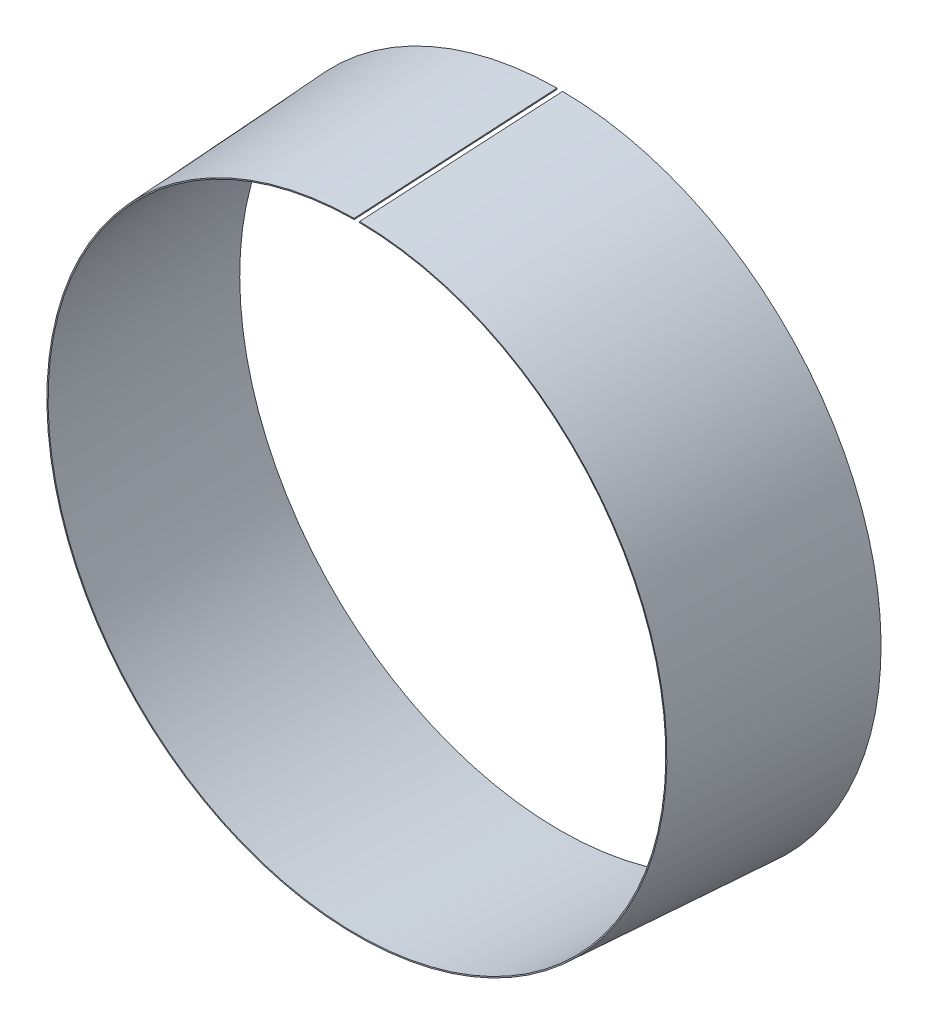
ISO-10303-21;
HEADER;
FILE_DESCRIPTION(('STEP AP214'),'2;1');
FILE_NAME('part.step','',(''),(''),'','','');
FILE_SCHEMA(('AUTOMOTIVE_DESIGN { 1 0 10303 214 1 1 1 1 }'));
ENDSEC;
DATA;
#1=APPLICATION_CONTEXT('core data for automotive mechanical design processes');
#2=APPLICATION_PROTOCOL_DEFINITION('international standard','automotive_design',2000,#1);
#3=PRODUCT_CONTEXT('',#1,'mechanical');
#4=PRODUCT('Part','Part','',(#3));
#5=PRODUCT_RELATED_PRODUCT_CATEGORY('part','',(#4));
#6=PRODUCT_DEFINITION_FORMATION('','',#4);
#7=PRODUCT_DEFINITION_CONTEXT('part definition',#1,'design');
#8=PRODUCT_DEFINITION('design','',#6,#7);
#9=PRODUCT_DEFINITION_SHAPE('','',#8);
#10=(LENGTH_UNIT() NAMED_UNIT(*) SI_UNIT(.MILLI.,.METRE.));
#11=(NAMED_UNIT(*) PLANE_ANGLE_UNIT() SI_UNIT($,.RADIAN.));
#12=(NAMED_UNIT(*) SI_UNIT($,.STERADIAN.) SOLID_ANGLE_UNIT());
#13=UNCERTAINTY_MEASURE_WITH_UNIT(LENGTH_MEASURE(1.E-05),#10,'distance_accuracy_value','');
#14=(GEOMETRIC_REPRESENTATION_CONTEXT(3) GLOBAL_UNCERTAINTY_ASSIGNED_CONTEXT((#13)) GLOBAL_UNIT_ASSIGNED_CONTEXT((#10,
#11,#12)) REPRESENTATION_CONTEXT('',''));
#15=CARTESIAN_POINT('',(0.,0.,0.));
#16=DIRECTION('',(0.,0.,1.));
#17=DIRECTION('',(1.,0.,0.));
#18=AXIS2_PLACEMENT_3D('',#15,#16,#17);
#19=CARTESIAN_POINT('',(-2.48706261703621,284.989148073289,0.));
#20=DIRECTION('',(-0.999961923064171,-0.00872653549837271,0.));
#21=DIRECTION('',(0.000484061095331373,-0.0554679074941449,0.998460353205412));
#22=AXIS2_PLACEMENT_3D('',#19,#20,#21);
#23=PLANE('',#22);
#24=DIRECTION('',(0.00871309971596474,-0.998422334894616,-0.0554700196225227));
#25=VECTOR('',#24,1.);
#26=CARTESIAN_POINT('',(-2.48706261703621,284.989148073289,0.));
#27=LINE('',#26,#25);
#28=CARTESIAN_POINT('',(-2.48706261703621,284.989148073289,0.));
#29=VERTEX_POINT('',#28);
#30=CARTESIAN_POINT('',(-2.47834951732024,283.990725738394,-0.0554700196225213));
#31=VERTEX_POINT('',#30);
#32=EDGE_CURVE('E12',#29,#31,#27,.T.);
#33=ORIENTED_EDGE('',*,*,#32,.F.);
#34=DIRECTION('',(0.000484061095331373,-0.0554679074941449,0.998460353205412));
#35=VECTOR('',#34,1.);
#36=CARTESIAN_POINT('',(-2.48706261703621,284.989148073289,0.));
#37=LINE('',#36,#35);
#38=CARTESIAN_POINT('',(-2.39979726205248,274.989528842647,180.));
#39=VERTEX_POINT('',#38);
#40=EDGE_CURVE('E98',#29,#39,#37,.T.);
#41=ORIENTED_EDGE('',*,*,#40,.T.);
#42=DIRECTION('',(0.00871309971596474,-0.998422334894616,-0.0554700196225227));
#43=VECTOR('',#42,1.);
#44=CARTESIAN_POINT('',(-2.39979726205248,274.989528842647,180.));
#45=LINE('',#44,#43);
#46=CARTESIAN_POINT('',(-2.39108416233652,273.991106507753,179.944529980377));
#47=VERTEX_POINT('',#46);
#48=EDGE_CURVE('E48',#39,#47,#45,.T.);
#49=ORIENTED_EDGE('',*,*,#48,.T.);
#50=DIRECTION('',(-0.000484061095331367,0.0554679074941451,-0.998460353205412));
#51=VECTOR('',#50,1.);
#52=CARTESIAN_POINT('',(-2.47834951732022,283.990725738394,-0.0554700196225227));
#53=LINE('',#52,#51);
#54=EDGE_CURVE('E107',#31,#47,#53,.F.);
#55=ORIENTED_EDGE('',*,*,#54,.F.);
#56=EDGE_LOOP('',(#33,#41,#49,#55));
#57=FACE_BOUND('',#56,.T.);
#58=ADVANCED_FACE('F38',(#57),#23,.F.);
#59=CARTESIAN_POINT('',(0.,0.,180.));
#60=DIRECTION('',(0.,0.,1.));
#61=DIRECTION('',(1.,0.,0.));
#62=AXIS2_PLACEMENT_3D('',#59,#60,#61);
#63=CONICAL_SURFACE('',#62,275.,1.51529782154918);
#64=ORIENTED_EDGE('',*,*,#48,.F.);
#65=CARTESIAN_POINT('',(0.,0.,180.));
#66=DIRECTION('',(0.,0.,1.));
#67=DIRECTION('',(1.,0.,0.));
#68=AXIS2_PLACEMENT_3D('',#65,#66,#67);
#69=CIRCLE('',#68,275.);
#70=CARTESIAN_POINT('',(2.39979726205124,274.989528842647,180.));
#71=VERTEX_POINT('',#70);
#72=EDGE_CURVE('E94',#39,#71,#69,.T.);
#73=ORIENTED_EDGE('',*,*,#72,.T.);
#74=DIRECTION('',(-0.00871309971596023,-0.998422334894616,-0.0554700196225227));
#75=VECTOR('',#74,1.);
#76=CARTESIAN_POINT('',(2.39979726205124,274.989528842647,180.));
#77=LINE('',#76,#75);
#78=CARTESIAN_POINT('',(2.39108416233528,273.991106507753,179.944529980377));
#79=VERTEX_POINT('',#78);
#80=EDGE_CURVE('E79',#71,#79,#77,.T.);
#81=ORIENTED_EDGE('',*,*,#80,.T.);
#82=CARTESIAN_POINT('',(0.,0.,179.944529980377));
#83=DIRECTION('',(0.,0.,-1.));
#84=DIRECTION('',(-1.,0.,0.));
#85=AXIS2_PLACEMENT_3D('',#82,#83,#84);
#86=CIRCLE('',#85,274.001539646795);
#87=EDGE_CURVE('E109',#47,#79,#86,.F.);
#88=ORIENTED_EDGE('',*,*,#87,.F.);
#89=EDGE_LOOP('',(#64,#73,#81,#88));
#90=FACE_BOUND('',#89,.T.);
#91=ADVANCED_FACE('F97',(#90),#63,.F.);
#92=CARTESIAN_POINT('',(2.48706261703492,284.989148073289,0.));
#93=DIRECTION('',(-0.999961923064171,0.0087265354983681,0.));
#94=DIRECTION('',(-0.000484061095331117,-0.0554679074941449,0.998460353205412));
#95=AXIS2_PLACEMENT_3D('',#92,#93,#94);
#96=PLANE('',#95);
#97=ORIENTED_EDGE('',*,*,#80,.F.);
#98=DIRECTION('',(-0.000484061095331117,-0.0554679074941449,0.998460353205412));
#99=VECTOR('',#98,1.);
#100=CARTESIAN_POINT('',(2.48706261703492,284.989148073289,0.));
#101=LINE('',#100,#99);
#102=CARTESIAN_POINT('',(2.48706261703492,284.989148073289,0.));
#103=VERTEX_POINT('',#102);
#104=EDGE_CURVE('E82',#103,#71,#101,.T.);
#105=ORIENTED_EDGE('',*,*,#104,.F.);
#106=DIRECTION('',(-0.00871309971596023,-0.998422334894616,-0.0554700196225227));
#107=VECTOR('',#106,1.);
#108=CARTESIAN_POINT('',(2.48706261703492,284.989148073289,0.));
#109=LINE('',#108,#107);
#110=CARTESIAN_POINT('',(2.47834951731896,283.990725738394,-0.0554700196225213));
#111=VERTEX_POINT('',#110);
#112=EDGE_CURVE('E42',#103,#111,#109,.T.);
#113=ORIENTED_EDGE('',*,*,#112,.T.);
#114=DIRECTION('',(0.000484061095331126,0.0554679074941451,-0.998460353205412));
#115=VECTOR('',#114,1.);
#116=CARTESIAN_POINT('',(2.47834951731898,283.990725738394,-0.0554700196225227));
#117=LINE('',#116,#115);
#118=EDGE_CURVE('E84',#111,#79,#117,.F.);
#119=ORIENTED_EDGE('',*,*,#118,.T.);
#120=EDGE_LOOP('',(#97,#105,#113,#119));
#121=FACE_BOUND('',#120,.T.);
#122=ADVANCED_FACE('F81',(#121),#96,.T.);
#123=CARTESIAN_POINT('',(0.,0.,0.));
#124=DIRECTION('',(0.,0.,1.));
#125=DIRECTION('',(1.,0.,0.));
#126=AXIS2_PLACEMENT_3D('',#123,#124,#125);
#127=CONICAL_SURFACE('',#126,285.,1.51529782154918);
#128=CARTESIAN_POINT('',(0.,0.,0.));
#129=DIRECTION('',(0.,0.,1.));
#130=DIRECTION('',(1.,0.,0.));
#131=AXIS2_PLACEMENT_3D('',#128,#129,#130);
#132=CIRCLE('',#131,285.);
#133=EDGE_CURVE('E95',#29,#103,#132,.T.);
#134=ORIENTED_EDGE('',*,*,#133,.F.);
#135=ORIENTED_EDGE('',*,*,#32,.T.);
#136=CARTESIAN_POINT('',(0.,0.,-0.0554700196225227));
#137=DIRECTION('',(0.,0.,-1.));
#138=DIRECTION('',(-1.,0.,0.));
#139=AXIS2_PLACEMENT_3D('',#136,#137,#138);
#140=CIRCLE('',#139,284.001539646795);
#141=EDGE_CURVE('E100',#31,#111,#140,.F.);
#142=ORIENTED_EDGE('',*,*,#141,.T.);
#143=ORIENTED_EDGE('',*,*,#112,.F.);
#144=EDGE_LOOP('',(#134,#135,#142,#143));
#145=FACE_BOUND('',#144,.T.);
#146=ADVANCED_FACE('F40',(#145),#127,.T.);
#147=CARTESIAN_POINT('',(0.,0.,-0.0554700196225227));
#148=DIRECTION('',(0.,0.,-1.));
#149=DIRECTION('',(-1.,0.,0.));
#150=AXIS2_PLACEMENT_3D('',#147,#148,#149);
#151=CONICAL_SURFACE('',#150,284.001539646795,0.0554985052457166);
#152=ORIENTED_EDGE('',*,*,#118,.F.);
#153=ORIENTED_EDGE('',*,*,#141,.F.);
#154=ORIENTED_EDGE('',*,*,#54,.T.);
#155=ORIENTED_EDGE('',*,*,#87,.T.);
#156=EDGE_LOOP('',(#152,#153,#154,#155));
#157=FACE_BOUND('',#156,.T.);
#158=ADVANCED_FACE('F112',(#157),#151,.F.);
#159=CARTESIAN_POINT('',(0.,0.,0.));
#160=DIRECTION('',(0.,0.,-1.));
#161=DIRECTION('',(-1.,0.,0.));
#162=AXIS2_PLACEMENT_3D('',#159,#160,#161);
#163=CONICAL_SURFACE('',#162,285.,0.0554985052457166);
#164=ORIENTED_EDGE('',*,*,#104,.T.);
#165=ORIENTED_EDGE('',*,*,#72,.F.);
#166=ORIENTED_EDGE('',*,*,#40,.F.);
#167=ORIENTED_EDGE('',*,*,#133,.T.);
#168=EDGE_LOOP('',(#164,#165,#166,#167));
#169=FACE_BOUND('',#168,.T.);
#170=ADVANCED_FACE('F92',(#169),#163,.T.);
#171=CLOSED_SHELL('',(#58,#91,#122,#146,#158,#170));
#172=MANIFOLD_SOLID_BREP('B2',#171);
#173=ADVANCED_BREP_SHAPE_REPRESENTATION('',(#18,#172),#14);
#174=SHAPE_DEFINITION_REPRESENTATION(#9,#173);
ENDSEC;
END-ISO-10303-21;
